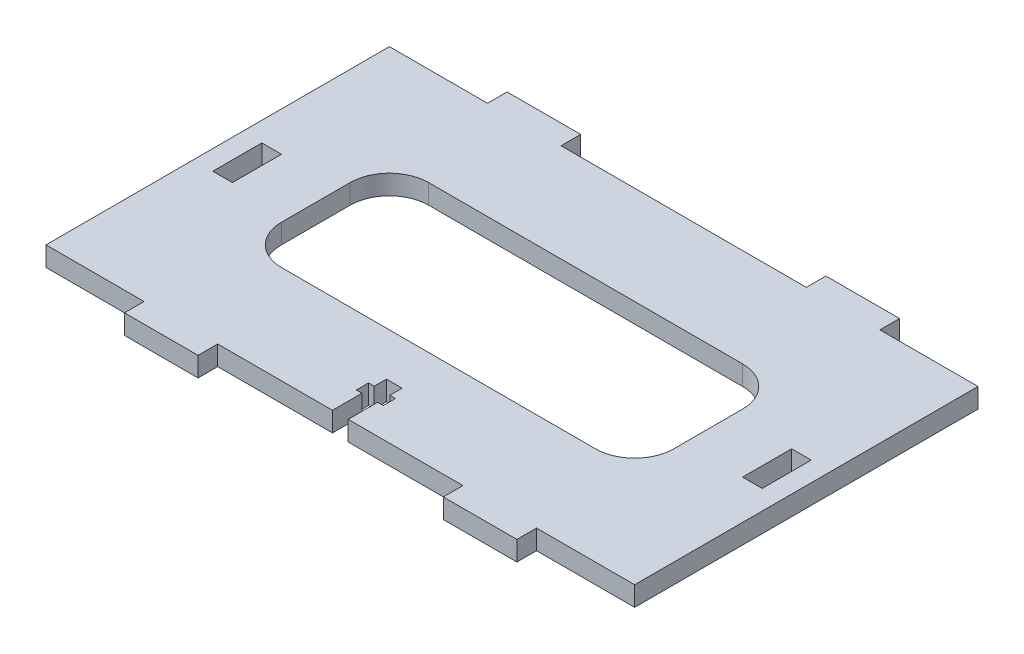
from build123d import *

# Parameters (mm, degrees)
SKIZZE1_W                       = 4
SKIZZE1_H                       = 10
AUFSATZ_LINEAR_AUSTRAGEN1_DEPTH = 4


with BuildPart() as part:
    # Skizze1 → Aufsatz-Linear austragen1 (new body)
    with BuildSketch(Plane(origin=(0, 0, 0), x_dir=(1, 0, 0), z_dir=(0, 1, 0))):
        Polygon((-60, 35), (-40, 35), (-40, 39), (-25, 39), (-25, 35), (25, 35), (25, 39), (40, 39), (40, 35), (60, 35), (60, -35), (40, -35), (40, -39), (25, -39), (25, -35), (1.6, -35), (1.6, -29), (2.75, -29), (2.75, -26.5), (1.6, -26.5), (1.6, -24), (-1.6, -24), (-1.6, -26.5), (-2.75, -26.5), (-2.75, -29), (-1.6, -29), (-1.6, -35), (-25, -35), (-25, -39), (-40, -39), (-40, -35), (-60, -35), align=None)
        with BuildLine():
            Line((-32, 15), (32, 15))
            ThreePointArc((32, 15), (37.656854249, 12.656854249), (40, 7))
            Line((40, 7), (40, -7))
            ThreePointArc((40, -7), (37.656854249, -12.656854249), (32, -15))
            Line((32, -15), (-32, -15))
            ThreePointArc((-32, -15), (-37.656854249, -12.656854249), (-40, -7))
            Line((-40, -7), (-40, 7))
            ThreePointArc((-40, 7), (-37.656854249, 12.656854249), (-32, 15))
        make_face(mode=Mode.SUBTRACT)
        with Locations((54, 0)):
            Rectangle(SKIZZE1_W, SKIZZE1_H, mode=Mode.SUBTRACT)
        with Locations((-54, 0)):
            Rectangle(SKIZZE1_W, SKIZZE1_H, mode=Mode.SUBTRACT)
    extrude(amount=AUFSATZ_LINEAR_AUSTRAGEN1_DEPTH)


solid = part.part
